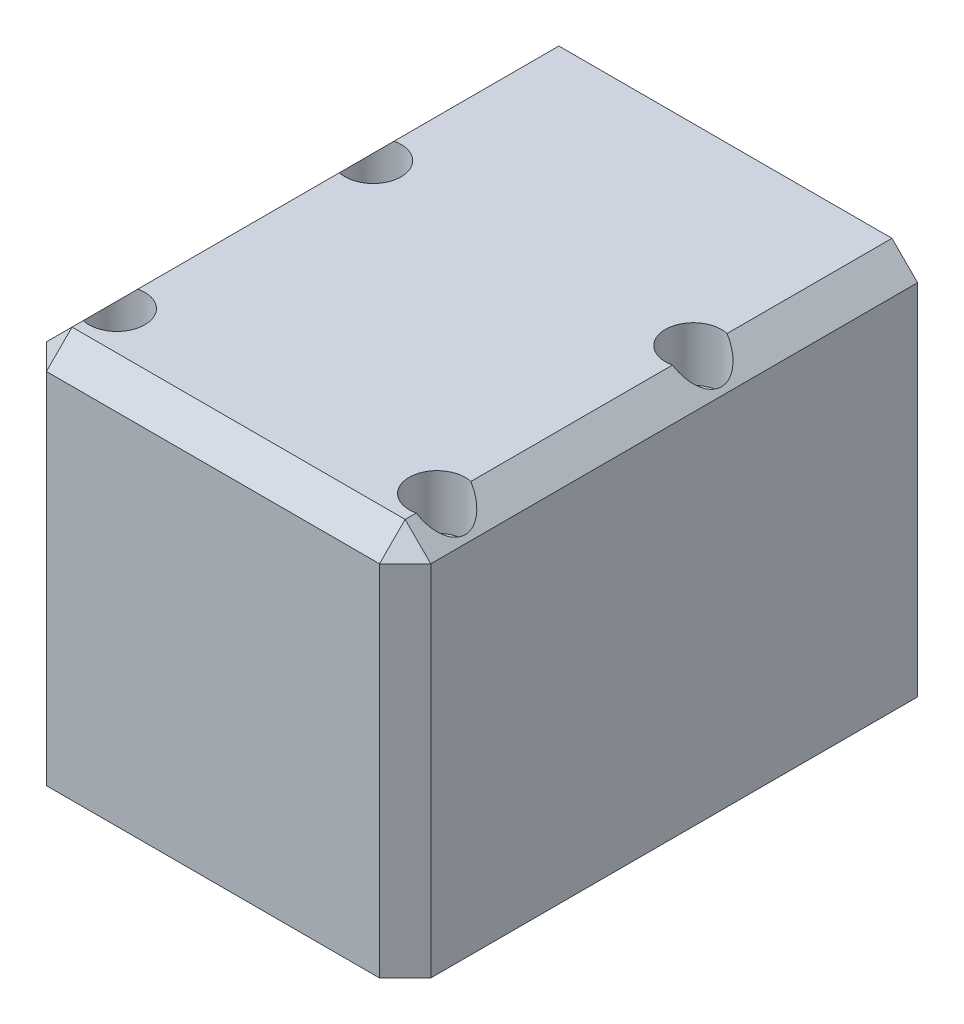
ISO-10303-21;
HEADER;
FILE_DESCRIPTION(('STEP AP214'),'2;1');
FILE_NAME('part.step','',(''),(''),'','','');
FILE_SCHEMA(('AUTOMOTIVE_DESIGN { 1 0 10303 214 1 1 1 1 }'));
ENDSEC;
DATA;
#1=APPLICATION_CONTEXT('core data for automotive mechanical design processes');
#2=APPLICATION_PROTOCOL_DEFINITION('international standard','automotive_design',2000,#1);
#3=PRODUCT_CONTEXT('',#1,'mechanical');
#4=PRODUCT('Part','Part','',(#3));
#5=PRODUCT_RELATED_PRODUCT_CATEGORY('part','',(#4));
#6=PRODUCT_DEFINITION_FORMATION('','',#4);
#7=PRODUCT_DEFINITION_CONTEXT('part definition',#1,'design');
#8=PRODUCT_DEFINITION('design','',#6,#7);
#9=PRODUCT_DEFINITION_SHAPE('','',#8);
#10=(LENGTH_UNIT() NAMED_UNIT(*) SI_UNIT(.MILLI.,.METRE.));
#11=(NAMED_UNIT(*) PLANE_ANGLE_UNIT() SI_UNIT($,.RADIAN.));
#12=(NAMED_UNIT(*) SI_UNIT($,.STERADIAN.) SOLID_ANGLE_UNIT());
#13=UNCERTAINTY_MEASURE_WITH_UNIT(LENGTH_MEASURE(1.E-05),#10,'distance_accuracy_value','');
#14=(GEOMETRIC_REPRESENTATION_CONTEXT(3) GLOBAL_UNCERTAINTY_ASSIGNED_CONTEXT((#13)) GLOBAL_UNIT_ASSIGNED_CONTEXT((#10,
#11,#12)) REPRESENTATION_CONTEXT('',''));
#15=CARTESIAN_POINT('',(0.,0.,0.));
#16=DIRECTION('',(0.,0.,1.));
#17=DIRECTION('',(1.,0.,0.));
#18=AXIS2_PLACEMENT_3D('',#15,#16,#17);
#19=CARTESIAN_POINT('',(0.,0.,50.8));
#20=DIRECTION('',(1.,0.,0.));
#21=DIRECTION('',(0.,1.,0.));
#22=AXIS2_PLACEMENT_3D('',#19,#20,#21);
#23=PLANE('',#22);
#24=DIRECTION('',(0.,0.,-1.));
#25=VECTOR('',#24,1.);
#26=CARTESIAN_POINT('',(0.,0.,50.8));
#27=LINE('',#26,#25);
#28=CARTESIAN_POINT('',(0.,0.,48.26));
#29=VERTEX_POINT('',#28);
#30=CARTESIAN_POINT('',(0.,0.,0.));
#31=VERTEX_POINT('',#30);
#32=EDGE_CURVE('E255',#29,#31,#27,.T.);
#33=ORIENTED_EDGE('',*,*,#32,.F.);
#34=DIRECTION('',(0.,1.,0.));
#35=VECTOR('',#34,1.);
#36=CARTESIAN_POINT('',(0.,0.,48.26));
#37=LINE('',#36,#35);
#38=CARTESIAN_POINT('',(0.,35.56,48.26));
#39=VERTEX_POINT('',#38);
#40=EDGE_CURVE('E257',#29,#39,#37,.T.);
#41=ORIENTED_EDGE('',*,*,#40,.T.);
#42=DIRECTION('',(0.,0.,-1.));
#43=VECTOR('',#42,1.);
#44=CARTESIAN_POINT('',(0.,35.56,50.8));
#45=LINE('',#44,#43);
#46=CARTESIAN_POINT('',(0.,35.56,0.));
#47=VERTEX_POINT('',#46);
#48=EDGE_CURVE('E275',#39,#47,#45,.T.);
#49=ORIENTED_EDGE('',*,*,#48,.T.);
#50=DIRECTION('',(0.,-1.,0.));
#51=VECTOR('',#50,1.);
#52=CARTESIAN_POINT('',(0.,0.,0.));
#53=LINE('',#52,#51);
#54=EDGE_CURVE('E260',#47,#31,#53,.T.);
#55=ORIENTED_EDGE('',*,*,#54,.T.);
#56=EDGE_LOOP('',(#33,#41,#49,#55));
#57=FACE_BOUND('',#56,.T.);
#58=ADVANCED_FACE('F36',(#57),#23,.F.);
#59=CARTESIAN_POINT('',(0.,0.,50.8));
#60=DIRECTION('',(0.,1.,0.));
#61=DIRECTION('',(0.,0.,1.));
#62=AXIS2_PLACEMENT_3D('',#59,#60,#61);
#63=PLANE('',#62);
#64=CARTESIAN_POINT('',(34.925,0.,44.45));
#65=DIRECTION('',(0.,1.,0.));
#66=DIRECTION('',(0.,0.,1.));
#67=AXIS2_PLACEMENT_3D('',#64,#65,#66);
#68=CIRCLE('',#67,1.63194999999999);
#69=CARTESIAN_POINT('',(34.925,0.,46.08195));
#70=VERTEX_POINT('',#69);
#71=EDGE_CURVE('E309',#70,#70,#68,.T.);
#72=ORIENTED_EDGE('',*,*,#71,.T.);
#73=EDGE_LOOP('',(#72));
#74=FACE_BOUND('',#73,.T.);
#75=CARTESIAN_POINT('',(34.925,0.,19.05));
#76=DIRECTION('',(0.,1.,0.));
#77=DIRECTION('',(0.,0.,1.));
#78=AXIS2_PLACEMENT_3D('',#75,#76,#77);
#79=CIRCLE('',#78,1.63194999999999);
#80=CARTESIAN_POINT('',(34.925,0.,20.68195));
#81=VERTEX_POINT('',#80);
#82=EDGE_CURVE('E682',#81,#81,#79,.T.);
#83=ORIENTED_EDGE('',*,*,#82,.T.);
#84=EDGE_LOOP('',(#83));
#85=FACE_BOUND('',#84,.T.);
#86=CARTESIAN_POINT('',(3.17499999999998,0.,19.05));
#87=DIRECTION('',(0.,1.,0.));
#88=DIRECTION('',(0.,0.,1.));
#89=AXIS2_PLACEMENT_3D('',#86,#87,#88);
#90=CIRCLE('',#89,1.63194999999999);
#91=CARTESIAN_POINT('',(3.17499999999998,0.,20.68195));
#92=VERTEX_POINT('',#91);
#93=EDGE_CURVE('E298',#92,#92,#90,.T.);
#94=ORIENTED_EDGE('',*,*,#93,.T.);
#95=EDGE_LOOP('',(#94));
#96=FACE_BOUND('',#95,.T.);
#97=CARTESIAN_POINT('',(3.17499999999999,0.,44.45));
#98=DIRECTION('',(0.,1.,0.));
#99=DIRECTION('',(0.,0.,1.));
#100=AXIS2_PLACEMENT_3D('',#97,#98,#99);
#101=CIRCLE('',#100,1.63194999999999);
#102=CARTESIAN_POINT('',(3.17499999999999,0.,46.08195));
#103=VERTEX_POINT('',#102);
#104=EDGE_CURVE('E699',#103,#103,#101,.T.);
#105=ORIENTED_EDGE('',*,*,#104,.T.);
#106=EDGE_LOOP('',(#105));
#107=FACE_BOUND('',#106,.T.);
#108=CARTESIAN_POINT('',(19.05,0.,34.798));
#109=DIRECTION('',(0.,-1.,0.));
#110=DIRECTION('',(0.,0.,-1.));
#111=AXIS2_PLACEMENT_3D('',#108,#109,#110);
#112=CIRCLE('',#111,9.525);
#113=CARTESIAN_POINT('',(19.05,0.,25.273));
#114=VERTEX_POINT('',#113);
#115=EDGE_CURVE('E165',#114,#114,#112,.T.);
#116=ORIENTED_EDGE('',*,*,#115,.F.);
#117=EDGE_LOOP('',(#116));
#118=FACE_BOUND('',#117,.T.);
#119=DIRECTION('',(0.,0.,-1.));
#120=VECTOR('',#119,1.);
#121=CARTESIAN_POINT('',(38.1,0.,50.8));
#122=LINE('',#121,#120);
#123=CARTESIAN_POINT('',(38.1,0.,48.26));
#124=VERTEX_POINT('',#123);
#125=CARTESIAN_POINT('',(38.1,0.,0.));
#126=VERTEX_POINT('',#125);
#127=EDGE_CURVE('E265',#124,#126,#122,.T.);
#128=ORIENTED_EDGE('',*,*,#127,.F.);
#129=DIRECTION('',(0.707106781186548,0.,-0.707106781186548));
#130=VECTOR('',#129,1.);
#131=CARTESIAN_POINT('',(35.56,0.,50.8));
#132=LINE('',#131,#130);
#133=CARTESIAN_POINT('',(35.56,0.,50.8));
#134=VERTEX_POINT('',#133);
#135=EDGE_CURVE('E279',#124,#134,#132,.F.);
#136=ORIENTED_EDGE('',*,*,#135,.T.);
#137=DIRECTION('',(1.,0.,0.));
#138=VECTOR('',#137,1.);
#139=CARTESIAN_POINT('',(0.,0.,50.8));
#140=LINE('',#139,#138);
#141=CARTESIAN_POINT('',(2.54,0.,50.8));
#142=VERTEX_POINT('',#141);
#143=EDGE_CURVE('E324',#142,#134,#140,.T.);
#144=ORIENTED_EDGE('',*,*,#143,.F.);
#145=DIRECTION('',(0.707106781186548,0.,0.707106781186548));
#146=VECTOR('',#145,1.);
#147=CARTESIAN_POINT('',(2.54,0.,50.8));
#148=LINE('',#147,#146);
#149=EDGE_CURVE('E270',#142,#29,#148,.F.);
#150=ORIENTED_EDGE('',*,*,#149,.T.);
#151=ORIENTED_EDGE('',*,*,#32,.T.);
#152=DIRECTION('',(1.,0.,0.));
#153=VECTOR('',#152,1.);
#154=CARTESIAN_POINT('',(0.,0.,0.));
#155=LINE('',#154,#153);
#156=EDGE_CURVE('E322',#31,#126,#155,.T.);
#157=ORIENTED_EDGE('',*,*,#156,.T.);
#158=EDGE_LOOP('',(#128,#136,#144,#150,#151,#157));
#159=FACE_BOUND('',#158,.T.);
#160=ADVANCED_FACE('F246',(#74,#85,#96,#107,#118,#159),#63,.F.);
#161=CARTESIAN_POINT('',(38.1,0.,50.8));
#162=DIRECTION('',(-1.,0.,0.));
#163=DIRECTION('',(0.,-1.,0.));
#164=AXIS2_PLACEMENT_3D('',#161,#162,#163);
#165=PLANE('',#164);
#166=DIRECTION('',(0.,0.,1.));
#167=VECTOR('',#166,1.);
#168=CARTESIAN_POINT('',(38.1,35.56,50.8));
#169=LINE('',#168,#167);
#170=CARTESIAN_POINT('',(38.1,35.56,0.));
#171=VERTEX_POINT('',#170);
#172=CARTESIAN_POINT('',(38.1,35.56,48.26));
#173=VERTEX_POINT('',#172);
#174=EDGE_CURVE('E314',#171,#173,#169,.T.);
#175=ORIENTED_EDGE('',*,*,#174,.T.);
#176=DIRECTION('',(0.,-1.,0.));
#177=VECTOR('',#176,1.);
#178=CARTESIAN_POINT('',(38.1,0.,48.26));
#179=LINE('',#178,#177);
#180=EDGE_CURVE('E339',#173,#124,#179,.T.);
#181=ORIENTED_EDGE('',*,*,#180,.T.);
#182=ORIENTED_EDGE('',*,*,#127,.T.);
#183=DIRECTION('',(0.,1.,0.));
#184=VECTOR('',#183,1.);
#185=CARTESIAN_POINT('',(38.1,0.,0.));
#186=LINE('',#185,#184);
#187=EDGE_CURVE('E318',#126,#171,#186,.T.);
#188=ORIENTED_EDGE('',*,*,#187,.T.);
#189=EDGE_LOOP('',(#175,#181,#182,#188));
#190=FACE_BOUND('',#189,.T.);
#191=ADVANCED_FACE('F251',(#190),#165,.F.);
#192=CARTESIAN_POINT('',(0.,38.1,50.8));
#193=DIRECTION('',(0.,-1.,0.));
#194=DIRECTION('',(0.,0.,-1.));
#195=AXIS2_PLACEMENT_3D('',#192,#193,#194);
#196=PLANE('',#195);
#197=DIRECTION('',(0.,0.,-1.));
#198=VECTOR('',#197,1.);
#199=CARTESIAN_POINT('',(35.56,38.1,50.8));
#200=LINE('',#199,#198);
#201=CARTESIAN_POINT('',(35.56,38.1,48.26));
#202=VERTEX_POINT('',#201);
#203=CARTESIAN_POINT('',(35.56,38.1,47.1552323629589));
#204=VERTEX_POINT('',#203);
#205=EDGE_CURVE('E139',#202,#204,#200,.T.);
#206=ORIENTED_EDGE('',*,*,#205,.T.);
#207=CARTESIAN_POINT('',(34.925,38.1,44.45));
#208=DIRECTION('',(0.,1.,0.));
#209=DIRECTION('',(0.,0.,1.));
#210=AXIS2_PLACEMENT_3D('',#207,#208,#209);
#211=CIRCLE('',#210,2.77875999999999);
#212=CARTESIAN_POINT('',(35.56,38.1,41.7447676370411));
#213=VERTEX_POINT('',#212);
#214=EDGE_CURVE('E48',#213,#204,#211,.T.);
#215=ORIENTED_EDGE('',*,*,#214,.F.);
#216=CARTESIAN_POINT('',(35.56,38.1,21.7552323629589));
#217=VERTEX_POINT('',#216);
#218=EDGE_CURVE('E55',#213,#217,#200,.T.);
#219=ORIENTED_EDGE('',*,*,#218,.T.);
#220=CARTESIAN_POINT('',(34.925,38.1,19.05));
#221=DIRECTION('',(0.,1.,0.));
#222=DIRECTION('',(0.,0.,1.));
#223=AXIS2_PLACEMENT_3D('',#220,#221,#222);
#224=CIRCLE('',#223,2.77875999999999);
#225=CARTESIAN_POINT('',(35.56,38.1,16.3447676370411));
#226=VERTEX_POINT('',#225);
#227=EDGE_CURVE('E306',#226,#217,#224,.T.);
#228=ORIENTED_EDGE('',*,*,#227,.F.);
#229=CARTESIAN_POINT('',(35.56,38.1,0.));
#230=VERTEX_POINT('',#229);
#231=EDGE_CURVE('E145',#226,#230,#200,.T.);
#232=ORIENTED_EDGE('',*,*,#231,.T.);
#233=DIRECTION('',(-1.,0.,0.));
#234=VECTOR('',#233,1.);
#235=CARTESIAN_POINT('',(0.,38.1,0.));
#236=LINE('',#235,#234);
#237=CARTESIAN_POINT('',(2.54,38.1,0.));
#238=VERTEX_POINT('',#237);
#239=EDGE_CURVE('E319',#230,#238,#236,.T.);
#240=ORIENTED_EDGE('',*,*,#239,.T.);
#241=DIRECTION('',(0.,0.,1.));
#242=VECTOR('',#241,1.);
#243=CARTESIAN_POINT('',(2.54,38.1,50.8));
#244=LINE('',#243,#242);
#245=CARTESIAN_POINT('',(2.54,38.1,16.3447676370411));
#246=VERTEX_POINT('',#245);
#247=EDGE_CURVE('E278',#238,#246,#244,.T.);
#248=ORIENTED_EDGE('',*,*,#247,.T.);
#249=CARTESIAN_POINT('',(3.17499999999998,38.1,19.05));
#250=DIRECTION('',(0.,1.,0.));
#251=DIRECTION('',(0.,0.,1.));
#252=AXIS2_PLACEMENT_3D('',#249,#250,#251);
#253=CIRCLE('',#252,2.77875999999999);
#254=CARTESIAN_POINT('',(2.54,38.1,21.7552323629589));
#255=VERTEX_POINT('',#254);
#256=EDGE_CURVE('E291',#255,#246,#253,.T.);
#257=ORIENTED_EDGE('',*,*,#256,.F.);
#258=CARTESIAN_POINT('',(2.54,38.1,41.7447676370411));
#259=VERTEX_POINT('',#258);
#260=EDGE_CURVE('E277',#255,#259,#244,.T.);
#261=ORIENTED_EDGE('',*,*,#260,.T.);
#262=CARTESIAN_POINT('',(3.17499999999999,38.1,44.45));
#263=DIRECTION('',(0.,1.,0.));
#264=DIRECTION('',(0.,0.,1.));
#265=AXIS2_PLACEMENT_3D('',#262,#263,#264);
#266=CIRCLE('',#265,2.77875999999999);
#267=CARTESIAN_POINT('',(2.54,38.1,47.1552323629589));
#268=VERTEX_POINT('',#267);
#269=EDGE_CURVE('E289',#268,#259,#266,.T.);
#270=ORIENTED_EDGE('',*,*,#269,.F.);
#271=CARTESIAN_POINT('',(2.54,38.1,48.26));
#272=VERTEX_POINT('',#271);
#273=EDGE_CURVE('E274',#268,#272,#244,.T.);
#274=ORIENTED_EDGE('',*,*,#273,.T.);
#275=DIRECTION('',(1.,0.,0.));
#276=VECTOR('',#275,1.);
#277=CARTESIAN_POINT('',(0.,38.1,48.26));
#278=LINE('',#277,#276);
#279=EDGE_CURVE('E148',#272,#202,#278,.T.);
#280=ORIENTED_EDGE('',*,*,#279,.T.);
#281=EDGE_LOOP('',(#206,#215,#219,#228,#232,#240,#248,#257,#261,#270,#274,#280));
#282=FACE_BOUND('',#281,.T.);
#283=ADVANCED_FACE('F138',(#282),#196,.F.);
#284=CARTESIAN_POINT('',(0.,38.1,50.8));
#285=DIRECTION('',(0.,0.,-1.));
#286=DIRECTION('',(-1.,0.,0.));
#287=AXIS2_PLACEMENT_3D('',#284,#285,#286);
#288=PLANE('',#287);
#289=ORIENTED_EDGE('',*,*,#143,.T.);
#290=DIRECTION('',(0.,1.,0.));
#291=VECTOR('',#290,1.);
#292=CARTESIAN_POINT('',(35.56,38.1,50.8));
#293=LINE('',#292,#291);
#294=CARTESIAN_POINT('',(35.56,35.56,50.8));
#295=VERTEX_POINT('',#294);
#296=EDGE_CURVE('E335',#134,#295,#293,.T.);
#297=ORIENTED_EDGE('',*,*,#296,.T.);
#298=DIRECTION('',(-1.,0.,0.));
#299=VECTOR('',#298,1.);
#300=CARTESIAN_POINT('',(0.,35.56,50.8));
#301=LINE('',#300,#299);
#302=CARTESIAN_POINT('',(2.54,35.56,50.8));
#303=VERTEX_POINT('',#302);
#304=EDGE_CURVE('E264',#295,#303,#301,.T.);
#305=ORIENTED_EDGE('',*,*,#304,.T.);
#306=DIRECTION('',(0.,-1.,0.));
#307=VECTOR('',#306,1.);
#308=CARTESIAN_POINT('',(2.54,38.1,50.8));
#309=LINE('',#308,#307);
#310=EDGE_CURVE('E333',#303,#142,#309,.T.);
#311=ORIENTED_EDGE('',*,*,#310,.T.);
#312=EDGE_LOOP('',(#289,#297,#305,#311));
#313=FACE_BOUND('',#312,.T.);
#314=ADVANCED_FACE('F346',(#313),#288,.F.);
#315=CARTESIAN_POINT('',(0.,38.1,0.));
#316=DIRECTION('',(0.,0.,-1.));
#317=DIRECTION('',(-1.,0.,0.));
#318=AXIS2_PLACEMENT_3D('',#315,#316,#317);
#319=PLANE('',#318);
#320=CARTESIAN_POINT('',(6.745,31.355,0.));
#321=DIRECTION('',(0.,0.,-1.));
#322=DIRECTION('',(-1.,0.,0.));
#323=AXIS2_PLACEMENT_3D('',#320,#321,#322);
#324=CIRCLE('',#323,1.1303);
#325=CARTESIAN_POINT('',(5.61470000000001,31.355,0.));
#326=VERTEX_POINT('',#325);
#327=EDGE_CURVE('E364',#326,#326,#324,.T.);
#328=ORIENTED_EDGE('',*,*,#327,.F.);
#329=EDGE_LOOP('',(#328));
#330=FACE_BOUND('',#329,.T.);
#331=CARTESIAN_POINT('',(6.745,6.74500000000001,0.));
#332=DIRECTION('',(0.,0.,-1.));
#333=DIRECTION('',(-1.,0.,0.));
#334=AXIS2_PLACEMENT_3D('',#331,#332,#333);
#335=CIRCLE('',#334,1.1303);
#336=CARTESIAN_POINT('',(5.61470000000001,6.74500000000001,0.));
#337=VERTEX_POINT('',#336);
#338=EDGE_CURVE('E374',#337,#337,#335,.T.);
#339=ORIENTED_EDGE('',*,*,#338,.F.);
#340=EDGE_LOOP('',(#339));
#341=FACE_BOUND('',#340,.T.);
#342=CARTESIAN_POINT('',(31.355,6.745,0.));
#343=DIRECTION('',(0.,0.,-1.));
#344=DIRECTION('',(-1.,0.,0.));
#345=AXIS2_PLACEMENT_3D('',#342,#343,#344);
#346=CIRCLE('',#345,1.1303);
#347=CARTESIAN_POINT('',(30.2247,6.745,0.));
#348=VERTEX_POINT('',#347);
#349=EDGE_CURVE('E380',#348,#348,#346,.T.);
#350=ORIENTED_EDGE('',*,*,#349,.F.);
#351=EDGE_LOOP('',(#350));
#352=FACE_BOUND('',#351,.T.);
#353=CARTESIAN_POINT('',(31.355,31.355,0.));
#354=DIRECTION('',(0.,0.,-1.));
#355=DIRECTION('',(-1.,0.,0.));
#356=AXIS2_PLACEMENT_3D('',#353,#354,#355);
#357=CIRCLE('',#356,1.1303);
#358=CARTESIAN_POINT('',(30.2247,31.355,0.));
#359=VERTEX_POINT('',#358);
#360=EDGE_CURVE('E386',#359,#359,#357,.T.);
#361=ORIENTED_EDGE('',*,*,#360,.F.);
#362=EDGE_LOOP('',(#361));
#363=FACE_BOUND('',#362,.T.);
#364=CARTESIAN_POINT('',(19.05,19.05,0.));
#365=DIRECTION('',(0.,0.,-1.));
#366=DIRECTION('',(-1.,0.,0.));
#367=AXIS2_PLACEMENT_3D('',#364,#365,#366);
#368=CIRCLE('',#367,13.97);
#369=CARTESIAN_POINT('',(5.08,19.05,0.));
#370=VERTEX_POINT('',#369);
#371=EDGE_CURVE('E389',#370,#370,#368,.T.);
#372=ORIENTED_EDGE('',*,*,#371,.F.);
#373=EDGE_LOOP('',(#372));
#374=FACE_BOUND('',#373,.T.);
#375=ORIENTED_EDGE('',*,*,#239,.F.);
#376=DIRECTION('',(-0.707106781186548,0.707106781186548,0.));
#377=VECTOR('',#376,1.);
#378=CARTESIAN_POINT('',(17.78,55.88,0.));
#379=LINE('',#378,#377);
#380=EDGE_CURVE('E153',#230,#171,#379,.F.);
#381=ORIENTED_EDGE('',*,*,#380,.T.);
#382=ORIENTED_EDGE('',*,*,#187,.F.);
#383=ORIENTED_EDGE('',*,*,#156,.F.);
#384=ORIENTED_EDGE('',*,*,#54,.F.);
#385=DIRECTION('',(-0.707106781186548,-0.707106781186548,0.));
#386=VECTOR('',#385,1.);
#387=CARTESIAN_POINT('',(1.27,36.83,0.));
#388=LINE('',#387,#386);
#389=EDGE_CURVE('E147',#47,#238,#388,.F.);
#390=ORIENTED_EDGE('',*,*,#389,.T.);
#391=EDGE_LOOP('',(#375,#381,#382,#383,#384,#390));
#392=FACE_BOUND('',#391,.T.);
#393=ADVANCED_FACE('F242',(#330,#341,#352,#363,#374,#392),#319,.T.);
#394=CARTESIAN_POINT('',(19.05,19.05,44.45));
#395=DIRECTION('',(0.,0.,-1.));
#396=DIRECTION('',(-1.,0.,0.));
#397=AXIS2_PLACEMENT_3D('',#394,#395,#396);
#398=CYLINDRICAL_SURFACE('',#397,13.97);
#399=CARTESIAN_POINT('',(19.05,5.08,25.273));
#400=CARTESIAN_POINT('',(19.2881217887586,5.08000073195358,25.2730007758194));
#401=CARTESIAN_POINT('',(19.5262553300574,5.08610162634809,25.281942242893));
#402=CARTESIAN_POINT('',(20.0005755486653,5.11035462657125,25.3175671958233));
#403=CARTESIAN_POINT('',(20.2367621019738,5.12850749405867,25.3442518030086));
#404=CARTESIAN_POINT('',(20.7054484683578,5.17643108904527,25.4149666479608));
#405=CARTESIAN_POINT('',(20.9379462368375,5.20620804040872,25.459006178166));
#406=CARTESIAN_POINT('',(21.3974405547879,5.27667591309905,25.5637873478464));
#407=CARTESIAN_POINT('',(21.6244371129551,5.31736681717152,25.6245289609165));
#408=CARTESIAN_POINT('',(22.0703260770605,5.40851719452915,25.7615526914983));
#409=CARTESIAN_POINT('',(22.2892542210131,5.45892524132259,25.8377531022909));
#410=CARTESIAN_POINT('',(22.7191350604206,5.56862090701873,26.0050314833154));
#411=CARTESIAN_POINT('',(22.9300846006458,5.62791199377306,26.0961152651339));
#412=CARTESIAN_POINT('',(23.3428970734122,5.75419193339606,26.2921867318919));
#413=CARTESIAN_POINT('',(23.5447635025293,5.82117778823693,26.3971690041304));
#414=CARTESIAN_POINT('',(23.9388403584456,5.96168751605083,26.6202158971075));
#415=CARTESIAN_POINT('',(24.1310471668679,6.03521381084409,26.7382853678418));
#416=CARTESIAN_POINT('',(24.5213207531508,6.19411874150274,26.9973739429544));
#417=CARTESIAN_POINT('',(24.7184627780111,6.27997266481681,27.1394941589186));
#418=CARTESIAN_POINT('',(25.1000837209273,6.45628810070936,27.437245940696));
#419=CARTESIAN_POINT('',(25.2845612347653,6.54675012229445,27.5928790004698));
#420=CARTESIAN_POINT('',(25.640680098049,6.73074426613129,27.9171107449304));
#421=CARTESIAN_POINT('',(25.8123015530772,6.82428083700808,28.0857287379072));
#422=CARTESIAN_POINT('',(26.1419553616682,7.01251316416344,28.4350249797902));
#423=CARTESIAN_POINT('',(26.2999919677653,7.10720854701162,28.615699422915));
#424=CARTESIAN_POINT('',(26.6272988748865,7.3116614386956,29.0197176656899));
#425=CARTESIAN_POINT('',(26.7940627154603,7.42130331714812,29.2451590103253));
#426=CARTESIAN_POINT('',(27.1079080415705,7.63653271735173,29.7112817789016));
#427=CARTESIAN_POINT('',(27.2549847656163,7.74211925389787,29.9519668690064));
#428=CARTESIAN_POINT('',(27.528166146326,7.94547177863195,30.4475677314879));
#429=CARTESIAN_POINT('',(27.6543041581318,8.04325007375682,30.702459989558));
#430=CARTESIAN_POINT('',(27.8845520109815,8.22718521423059,31.226154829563));
#431=CARTESIAN_POINT('',(27.9886615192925,8.31334188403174,31.4949576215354));
#432=CARTESIAN_POINT('',(28.1454997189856,8.4462286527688,31.9627155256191));
#433=CARTESIAN_POINT('',(28.2042806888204,8.49704136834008,32.1584980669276));
#434=CARTESIAN_POINT('',(28.3095123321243,8.58925294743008,32.5554197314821));
#435=CARTESIAN_POINT('',(28.3559709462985,8.63065787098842,32.7565553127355));
#436=CARTESIAN_POINT('',(28.4359129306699,8.70261207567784,33.163036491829));
#437=CARTESIAN_POINT('',(28.4694133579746,8.73317562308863,33.3683761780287));
#438=CARTESIAN_POINT('',(28.5229817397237,8.78233974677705,33.7822388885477));
#439=CARTESIAN_POINT('',(28.5430496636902,8.80094029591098,33.9907619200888));
#440=CARTESIAN_POINT('',(28.5694460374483,8.8254521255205,34.410454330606));
#441=CARTESIAN_POINT('',(28.5757070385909,8.83130111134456,34.621631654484));
#442=CARTESIAN_POINT('',(28.574166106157,8.82986493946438,35.0438893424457));
#443=CARTESIAN_POINT('',(28.5663641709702,8.82257978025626,35.2549697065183));
#444=CARTESIAN_POINT('',(28.5368424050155,8.79519036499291,35.6754364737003));
#445=CARTESIAN_POINT('',(28.5151139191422,8.77507813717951,35.8848217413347));
#446=CARTESIAN_POINT('',(28.4581316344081,8.72287821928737,36.3002132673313));
#447=CARTESIAN_POINT('',(28.4228775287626,8.69079025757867,36.5062194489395));
#448=CARTESIAN_POINT('',(28.3416690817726,8.61790601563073,36.9025650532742));
#449=CARTESIAN_POINT('',(28.2963960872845,8.57767416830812,37.0931494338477));
#450=CARTESIAN_POINT('',(28.1947991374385,8.4888397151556,37.4693823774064));
#451=CARTESIAN_POINT('',(28.1384710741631,8.44023399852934,37.6550290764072));
#452=CARTESIAN_POINT('',(27.9536777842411,8.28378323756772,38.2037362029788));
#453=CARTESIAN_POINT('',(27.8093965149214,8.16529807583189,38.5585968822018));
#454=CARTESIAN_POINT('',(27.5241878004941,7.94266013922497,39.1562192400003));
#455=CARTESIAN_POINT('',(27.3916554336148,7.84247082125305,39.4046196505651));
#456=CARTESIAN_POINT('',(27.1064559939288,7.63573566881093,39.886969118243));
#457=CARTESIAN_POINT('',(26.953781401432,7.52918746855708,40.120912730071));
#458=CARTESIAN_POINT('',(26.6290045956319,7.31297647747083,40.5739988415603));
#459=CARTESIAN_POINT('',(26.4568703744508,7.20330878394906,40.7931159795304));
#460=CARTESIAN_POINT('',(26.0940945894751,6.9840750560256,41.2154627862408));
#461=CARTESIAN_POINT('',(25.9034552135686,6.8745090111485,41.4186943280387));
#462=CARTESIAN_POINT('',(25.5024498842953,6.65729012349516,41.8101848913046));
#463=CARTESIAN_POINT('',(25.2919213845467,6.54966348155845,41.998292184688));
#464=CARTESIAN_POINT('',(24.8532388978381,6.34006651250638,42.3563193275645));
#465=CARTESIAN_POINT('',(24.6250833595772,6.23809668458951,42.5262375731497));
#466=CARTESIAN_POINT('',(24.1524126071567,6.04263376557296,42.8461238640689));
#467=CARTESIAN_POINT('',(23.90792737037,5.94912584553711,42.9961270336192));
#468=CARTESIAN_POINT('',(23.4034123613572,5.77295118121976,43.2748158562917));
#469=CARTESIAN_POINT('',(23.1433872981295,5.69028117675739,43.4035079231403));
#470=CARTESIAN_POINT('',(22.6686471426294,5.55507504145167,43.6117685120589));
#471=CARTESIAN_POINT('',(22.4566685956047,5.49992165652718,43.6959022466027));
#472=CARTESIAN_POINT('',(22.0252953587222,5.3987155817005,43.8492770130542));
#473=CARTESIAN_POINT('',(21.8059021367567,5.35266110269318,43.9185209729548));
#474=CARTESIAN_POINT('',(21.3610185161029,5.27062302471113,44.0412698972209));
#475=CARTESIAN_POINT('',(21.135531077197,5.23463463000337,44.0947823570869));
#476=CARTESIAN_POINT('',(20.6798183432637,5.17349330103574,44.1854002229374));
#477=CARTESIAN_POINT('',(20.4495929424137,5.14834060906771,44.2225052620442));
#478=CARTESIAN_POINT('',(19.9852735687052,5.10938938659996,44.2798666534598));
#479=CARTESIAN_POINT('',(19.7511689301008,5.09563062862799,44.3000639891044));
#480=CARTESIAN_POINT('',(19.2817080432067,5.07994743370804,44.3230808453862));
#481=CARTESIAN_POINT('',(19.0463517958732,5.07802298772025,44.3259003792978));
#482=CARTESIAN_POINT('',(18.5762723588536,5.08605547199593,44.3141173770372));
#483=CARTESIAN_POINT('',(18.3415491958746,5.09601289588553,44.2995141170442));
#484=CARTESIAN_POINT('',(17.874609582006,5.12756799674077,44.2531111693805));
#485=CARTESIAN_POINT('',(17.642393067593,5.14916537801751,44.2213119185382));
#486=CARTESIAN_POINT('',(17.1947620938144,5.20200399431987,44.1431857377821));
#487=CARTESIAN_POINT('',(16.97912180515,5.23265529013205,44.0977453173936));
#488=CARTESIAN_POINT('',(16.5528752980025,5.30329294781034,43.9924659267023));
#489=CARTESIAN_POINT('',(16.3422708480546,5.34328253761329,43.93262197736));
#490=CARTESIAN_POINT('',(15.9273715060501,5.43181069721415,43.7992383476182));
#491=CARTESIAN_POINT('',(15.7230748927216,5.48034691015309,43.72570244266));
#492=CARTESIAN_POINT('',(15.3216032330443,5.5851190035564,43.5656340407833));
#493=CARTESIAN_POINT('',(15.1244308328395,5.64135770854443,43.4790967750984));
#494=CARTESIAN_POINT('',(14.7227019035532,5.76530905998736,43.286439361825));
#495=CARTESIAN_POINT('',(14.518801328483,5.83357810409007,43.1793100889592));
#496=CARTESIAN_POINT('',(14.1209402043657,5.976745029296,42.9516834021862));
#497=CARTESIAN_POINT('',(13.9269838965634,6.05164570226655,42.831180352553));
#498=CARTESIAN_POINT('',(13.5495880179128,6.2067913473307,42.5776396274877));
#499=CARTESIAN_POINT('',(13.3661525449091,6.28703837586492,42.4445971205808));
#500=CARTESIAN_POINT('',(13.0102989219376,6.4515340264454,42.1667586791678));
#501=CARTESIAN_POINT('',(12.8378819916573,6.53578308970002,42.0219614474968));
#502=CARTESIAN_POINT('',(12.4764157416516,6.72130234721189,41.6959980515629));
#503=CARTESIAN_POINT('',(12.2894353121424,6.82305511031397,41.5128077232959));
#504=CARTESIAN_POINT('',(11.9314780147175,7.02793350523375,41.1320793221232));
#505=CARTESIAN_POINT('',(11.7605036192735,7.13105934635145,40.9345390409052));
#506=CARTESIAN_POINT('',(11.4350225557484,7.33633055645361,40.5256575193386));
#507=CARTESIAN_POINT('',(11.2805241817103,7.43847540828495,40.3143094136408));
#508=CARTESIAN_POINT('',(10.9887505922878,7.63910641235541,39.8784183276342));
#509=CARTESIAN_POINT('',(10.8514726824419,7.73759313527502,39.6538774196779));
#510=CARTESIAN_POINT('',(10.6124091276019,7.91505424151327,39.2234674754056));
#511=CARTESIAN_POINT('',(10.5083355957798,7.99486081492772,39.0192114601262));
#512=CARTESIAN_POINT('',(10.3143418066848,8.14750443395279,38.601539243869));
#513=CARTESIAN_POINT('',(10.2244213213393,8.22034159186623,38.3881231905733));
#514=CARTESIAN_POINT('',(10.0597082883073,8.35668551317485,37.9530426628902));
#515=CARTESIAN_POINT('',(9.98489134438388,8.4202072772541,37.7313921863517));
#516=CARTESIAN_POINT('',(9.8511654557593,8.53571603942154,37.2804068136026));
#517=CARTESIAN_POINT('',(9.79225316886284,8.58770546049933,37.0510735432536));
#518=CARTESIAN_POINT('',(9.69977233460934,8.67034130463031,36.6250455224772));
#519=CARTESIAN_POINT('',(9.66361097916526,8.70310446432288,36.4293227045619));
#520=CARTESIAN_POINT('',(9.60349672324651,8.75795739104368,36.0345454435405));
#521=CARTESIAN_POINT('',(9.57954148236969,8.78004920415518,35.8354916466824));
#522=CARTESIAN_POINT('',(9.5442364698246,8.81271800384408,35.435470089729));
#523=CARTESIAN_POINT('',(9.53287735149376,8.82330352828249,35.2345038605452));
#524=CARTESIAN_POINT('',(9.52293321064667,8.83256653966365,34.831973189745));
#525=CARTESIAN_POINT('',(9.52434843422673,8.8312437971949,34.6304087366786));
#526=CARTESIAN_POINT('',(9.53992447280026,8.8167466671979,34.2283029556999));
#527=CARTESIAN_POINT('',(9.55407924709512,8.80357789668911,34.0277611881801));
#528=CARTESIAN_POINT('',(9.59487806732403,8.76591842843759,33.6290428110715));
#529=CARTESIAN_POINT('',(9.62152202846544,8.74142780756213,33.4308661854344));
#530=CARTESIAN_POINT('',(9.68690942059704,8.68200208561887,33.0379223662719));
#531=CARTESIAN_POINT('',(9.72566470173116,8.64705675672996,32.8431587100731));
#532=CARTESIAN_POINT('',(9.8147557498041,8.56788621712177,32.4581344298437));
#533=CARTESIAN_POINT('',(9.86509810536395,8.5236557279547,32.2678764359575));
#534=CARTESIAN_POINT('',(9.99449463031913,8.41194757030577,31.8332274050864));
#535=CARTESIAN_POINT('',(10.0775920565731,8.34154452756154,31.5907853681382));
#536=CARTESIAN_POINT('',(10.2616483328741,8.18998269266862,31.116243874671));
#537=CARTESIAN_POINT('',(10.3626138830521,8.10881986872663,30.8841483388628));
#538=CARTESIAN_POINT('',(10.5814470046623,7.93857590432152,30.4307736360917));
#539=CARTESIAN_POINT('',(10.6993336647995,7.84948586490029,30.2095070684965));
#540=CARTESIAN_POINT('',(10.9510531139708,7.66614288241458,29.7785418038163));
#541=CARTESIAN_POINT('',(11.0848848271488,7.5718902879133,29.5688423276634));
#542=CARTESIAN_POINT('',(11.3707169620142,7.3786730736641,29.1572298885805));
#543=CARTESIAN_POINT('',(11.5230314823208,7.27965161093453,28.955561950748));
#544=CARTESIAN_POINT('',(11.843087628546,7.08100648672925,28.5650393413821));
#545=CARTESIAN_POINT('',(12.010835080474,6.98138261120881,28.376189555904));
#546=CARTESIAN_POINT('',(12.361277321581,6.78368977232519,28.0119490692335));
#547=CARTESIAN_POINT('',(12.5439744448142,6.68562105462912,27.8365604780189));
#548=CARTESIAN_POINT('',(12.92382929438,6.49307846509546,27.5000525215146));
#549=CARTESIAN_POINT('',(13.1209866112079,6.39860449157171,27.3389327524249));
#550=CARTESIAN_POINT('',(13.5560844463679,6.20313767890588,27.0117297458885));
#551=CARTESIAN_POINT('',(13.7959810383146,6.1029173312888,26.8477718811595));
#552=CARTESIAN_POINT('',(14.2926829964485,5.91228341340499,26.5409565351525));
#553=CARTESIAN_POINT('',(14.5494910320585,5.82187139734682,26.398102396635));
#554=CARTESIAN_POINT('',(15.0781174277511,5.65366275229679,26.135626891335));
#555=CARTESIAN_POINT('',(15.3499100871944,5.57584537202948,26.0159672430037));
#556=CARTESIAN_POINT('',(15.9068383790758,5.43516224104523,25.8016073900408));
#557=CARTESIAN_POINT('',(16.1919679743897,5.37228980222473,25.7068960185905));
#558=CARTESIAN_POINT('',(16.6889375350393,5.27936086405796,25.5677747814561));
#559=CARTESIAN_POINT('',(16.8981590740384,5.24507114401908,25.5167374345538));
#560=CARTESIAN_POINT('',(17.3208317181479,5.18578778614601,25.4287862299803));
#561=CARTESIAN_POINT('',(17.5342819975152,5.16079235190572,25.391869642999));
#562=CARTESIAN_POINT('',(17.9640186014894,5.12060307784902,25.3326264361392));
#563=CARTESIAN_POINT('',(18.180303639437,5.10540493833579,25.3102934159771));
#564=CARTESIAN_POINT('',(18.6143890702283,5.08510253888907,25.2804790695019));
#565=CARTESIAN_POINT('',(18.8321896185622,5.07999933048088,25.2729992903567));
#566=CARTESIAN_POINT('',(19.05,5.08,25.273));
#567=B_SPLINE_CURVE_WITH_KNOTS('',3,(#399,#400,#401,#402,#403,#404,#405,#406,#407,#408,#409,
#410,#411,#412,#413,#414,#415,#416,#417,#418,#419,#420,#421,#422,#423,#424,#425,#426,#427,#428,
#429,#430,#431,#432,#433,#434,#435,#436,#437,#438,#439,#440,#441,#442,#443,#444,#445,#446,#447,
#448,#449,#450,#451,#452,#453,#454,#455,#456,#457,#458,#459,#460,#461,#462,#463,#464,#465,#466,
#467,#468,#469,#470,#471,#472,#473,#474,#475,#476,#477,#478,#479,#480,#481,#482,#483,#484,#485,
#486,#487,#488,#489,#490,#491,#492,#493,#494,#495,#496,#497,#498,#499,#500,#501,#502,#503,#504,
#505,#506,#507,#508,#509,#510,#511,#512,#513,#514,#515,#516,#517,#518,#519,#520,#521,#522,#523,
#524,#525,#526,#527,#528,#529,#530,#531,#532,#533,#534,#535,#536,#537,#538,#539,#540,#541,#542,
#543,#544,#545,#546,#547,#548,#549,#550,#551,#552,#553,#554,#555,#556,#557,#558,#559,#560,#561,
#562,#563,#564,#565,#566),.UNSPECIFIED.,.T.,.F.,(4,2,2,2,2,2,2,2,2,2,2,2,2,2,2,2,2,2,2,2,2,2,2,
2,2,2,2,2,2,2,2,2,2,2,2,2,2,2,2,2,2,2,2,2,2,2,2,2,2,2,2,2,2,2,2,2,2,2,2,2,2,2,2,2,2,2,2,2,2,2,2,
2,2,2,2,2,2,2,2,2,2,2,2,4),(0.,0.714142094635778,1.42832932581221,2.14289947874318,
2.85746850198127,3.56835474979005,4.27951924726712,4.99040759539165,5.70156027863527,
6.47405865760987,7.24664255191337,8.0203983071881,8.79391096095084,9.69613383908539,
10.5985745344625,11.4995635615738,12.4005661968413,13.031913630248,13.662853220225,
14.2929594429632,14.9230670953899,15.5562461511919,16.1894252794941,16.8229982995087,
17.4565856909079,18.0559273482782,18.6554921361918,19.8545189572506,20.7500492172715,
21.6459147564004,22.543275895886,23.4405310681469,24.3458862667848,25.2513212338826,
26.1551374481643,27.0586811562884,27.7618924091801,28.4649652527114,29.1677025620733,
29.8704555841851,30.5756514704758,31.2808468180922,31.9860714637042,32.6912781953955,
33.358039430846,34.025031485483,34.6918398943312,35.3588934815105,36.0788890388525,
36.7991891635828,37.5197679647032,38.2404263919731,39.0821002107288,39.9239038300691,
40.7661292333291,41.608222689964,42.3358055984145,43.0633767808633,43.7897631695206,
44.515996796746,45.1205098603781,45.7249069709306,46.3288553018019,46.9328152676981,
47.5364890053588,48.1401586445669,48.7444207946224,49.349027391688,50.1452063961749,
50.9416845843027,51.7390684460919,52.5363985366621,53.3499410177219,54.1637918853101,
54.9777700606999,55.7917251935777,56.7125400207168,57.6335005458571,58.5529278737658,
59.4719429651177,60.1255152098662,60.7789610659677,61.4321199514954,62.0853468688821),.UNSPECIFIED.);
#568=CARTESIAN_POINT('',(19.05,5.08,25.273));
#569=VERTEX_POINT('',#568);
#570=EDGE_CURVE('E156',#569,#569,#567,.T.);
#571=ORIENTED_EDGE('',*,*,#570,.T.);
#572=EDGE_LOOP('',(#571));
#573=FACE_BOUND('',#572,.T.);
#574=CARTESIAN_POINT('',(19.05,19.05,44.45));
#575=DIRECTION('',(0.,0.,-1.));
#576=DIRECTION('',(-1.,0.,0.));
#577=AXIS2_PLACEMENT_3D('',#574,#575,#576);
#578=CIRCLE('',#577,13.97);
#579=CARTESIAN_POINT('',(5.08,19.05,44.45));
#580=VERTEX_POINT('',#579);
#581=EDGE_CURVE('E392',#580,#580,#578,.T.);
#582=ORIENTED_EDGE('',*,*,#581,.F.);
#583=EDGE_LOOP('',(#582));
#584=FACE_BOUND('',#583,.T.);
#585=ORIENTED_EDGE('',*,*,#371,.T.);
#586=EDGE_LOOP('',(#585));
#587=FACE_BOUND('',#586,.T.);
#588=ADVANCED_FACE('F167',(#573,#584,#587),#398,.F.);
#589=CARTESIAN_POINT('',(19.05,19.05,44.45));
#590=DIRECTION('',(0.,0.,-1.));
#591=DIRECTION('',(-1.,0.,0.));
#592=AXIS2_PLACEMENT_3D('',#589,#590,#591);
#593=PLANE('',#592);
#594=ORIENTED_EDGE('',*,*,#581,.T.);
#595=EDGE_LOOP('',(#594));
#596=FACE_BOUND('',#595,.T.);
#597=ADVANCED_FACE('F235',(#596),#593,.T.);
#598=CARTESIAN_POINT('',(31.355,31.355,0.));
#599=DIRECTION('',(0.,0.,-1.));
#600=DIRECTION('',(-1.,0.,0.));
#601=AXIS2_PLACEMENT_3D('',#598,#599,#600);
#602=CYLINDRICAL_SURFACE('',#601,1.1303);
#603=CARTESIAN_POINT('',(31.355,31.355,8.8646));
#604=DIRECTION('',(0.,0.,-1.));
#605=DIRECTION('',(-1.,0.,0.));
#606=AXIS2_PLACEMENT_3D('',#603,#604,#605);
#607=CIRCLE('',#606,1.13029999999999);
#608=CARTESIAN_POINT('',(30.2247,31.355,8.8646));
#609=VERTEX_POINT('',#608);
#610=EDGE_CURVE('E383',#609,#609,#607,.T.);
#611=ORIENTED_EDGE('',*,*,#610,.F.);
#612=EDGE_LOOP('',(#611));
#613=FACE_BOUND('',#612,.T.);
#614=ORIENTED_EDGE('',*,*,#360,.T.);
#615=EDGE_LOOP('',(#614));
#616=FACE_BOUND('',#615,.T.);
#617=ADVANCED_FACE('F232',(#613,#616),#602,.F.);
#618=CARTESIAN_POINT('',(31.355,31.355,8.8646));
#619=DIRECTION('',(0.,0.,-1.));
#620=DIRECTION('',(-1.,0.,0.));
#621=AXIS2_PLACEMENT_3D('',#618,#619,#620);
#622=CONICAL_SURFACE('',#621,1.13029999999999,1.02974425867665);
#623=CARTESIAN_POINT('',(31.355,31.355,9.54375275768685));
#624=VERTEX_POINT('',#623);
#625=VERTEX_LOOP('',#624);
#626=FACE_BOUND('',#625,.T.);
#627=ORIENTED_EDGE('',*,*,#610,.T.);
#628=EDGE_LOOP('',(#627));
#629=FACE_BOUND('',#628,.T.);
#630=ADVANCED_FACE('F228',(#626,#629),#622,.F.);
#631=CARTESIAN_POINT('',(31.355,6.745,0.));
#632=DIRECTION('',(0.,0.,-1.));
#633=DIRECTION('',(-1.,0.,0.));
#634=AXIS2_PLACEMENT_3D('',#631,#632,#633);
#635=CYLINDRICAL_SURFACE('',#634,1.1303);
#636=CARTESIAN_POINT('',(31.355,6.745,8.8646));
#637=DIRECTION('',(0.,0.,-1.));
#638=DIRECTION('',(-1.,0.,0.));
#639=AXIS2_PLACEMENT_3D('',#636,#637,#638);
#640=CIRCLE('',#639,1.13029999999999);
#641=CARTESIAN_POINT('',(30.2247,6.745,8.8646));
#642=VERTEX_POINT('',#641);
#643=EDGE_CURVE('E377',#642,#642,#640,.T.);
#644=ORIENTED_EDGE('',*,*,#643,.F.);
#645=EDGE_LOOP('',(#644));
#646=FACE_BOUND('',#645,.T.);
#647=ORIENTED_EDGE('',*,*,#349,.T.);
#648=EDGE_LOOP('',(#647));
#649=FACE_BOUND('',#648,.T.);
#650=ADVANCED_FACE('F224',(#646,#649),#635,.F.);
#651=CARTESIAN_POINT('',(31.355,6.745,8.8646));
#652=DIRECTION('',(0.,0.,-1.));
#653=DIRECTION('',(-1.,0.,0.));
#654=AXIS2_PLACEMENT_3D('',#651,#652,#653);
#655=CONICAL_SURFACE('',#654,1.13029999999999,1.02974425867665);
#656=CARTESIAN_POINT('',(31.355,6.745,9.54375275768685));
#657=VERTEX_POINT('',#656);
#658=VERTEX_LOOP('',#657);
#659=FACE_BOUND('',#658,.T.);
#660=ORIENTED_EDGE('',*,*,#643,.T.);
#661=EDGE_LOOP('',(#660));
#662=FACE_BOUND('',#661,.T.);
#663=ADVANCED_FACE('F220',(#659,#662),#655,.F.);
#664=CARTESIAN_POINT('',(6.745,6.74500000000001,0.));
#665=DIRECTION('',(0.,0.,-1.));
#666=DIRECTION('',(-1.,0.,0.));
#667=AXIS2_PLACEMENT_3D('',#664,#665,#666);
#668=CYLINDRICAL_SURFACE('',#667,1.1303);
#669=CARTESIAN_POINT('',(6.745,6.74500000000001,8.8646));
#670=DIRECTION('',(0.,0.,-1.));
#671=DIRECTION('',(-1.,0.,0.));
#672=AXIS2_PLACEMENT_3D('',#669,#670,#671);
#673=CIRCLE('',#672,1.1303);
#674=CARTESIAN_POINT('',(5.61470000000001,6.74500000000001,8.8646));
#675=VERTEX_POINT('',#674);
#676=EDGE_CURVE('E371',#675,#675,#673,.T.);
#677=ORIENTED_EDGE('',*,*,#676,.F.);
#678=EDGE_LOOP('',(#677));
#679=FACE_BOUND('',#678,.T.);
#680=ORIENTED_EDGE('',*,*,#338,.T.);
#681=EDGE_LOOP('',(#680));
#682=FACE_BOUND('',#681,.T.);
#683=ADVANCED_FACE('F216',(#679,#682),#668,.F.);
#684=CARTESIAN_POINT('',(6.745,6.74500000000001,8.8646));
#685=DIRECTION('',(0.,0.,-1.));
#686=DIRECTION('',(-1.,0.,0.));
#687=AXIS2_PLACEMENT_3D('',#684,#685,#686);
#688=CONICAL_SURFACE('',#687,1.1303,1.02974425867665);
#689=CARTESIAN_POINT('',(6.745,6.74500000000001,9.54375275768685));
#690=VERTEX_POINT('',#689);
#691=VERTEX_LOOP('',#690);
#692=FACE_BOUND('',#691,.T.);
#693=ORIENTED_EDGE('',*,*,#676,.T.);
#694=EDGE_LOOP('',(#693));
#695=FACE_BOUND('',#694,.T.);
#696=ADVANCED_FACE('F212',(#692,#695),#688,.F.);
#697=CARTESIAN_POINT('',(6.745,31.355,0.));
#698=DIRECTION('',(0.,0.,-1.));
#699=DIRECTION('',(-1.,0.,0.));
#700=AXIS2_PLACEMENT_3D('',#697,#698,#699);
#701=CYLINDRICAL_SURFACE('',#700,1.1303);
#702=CARTESIAN_POINT('',(6.745,31.355,8.8646));
#703=DIRECTION('',(0.,0.,-1.));
#704=DIRECTION('',(-1.,0.,0.));
#705=AXIS2_PLACEMENT_3D('',#702,#703,#704);
#706=CIRCLE('',#705,1.1303);
#707=CARTESIAN_POINT('',(5.61470000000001,31.355,8.8646));
#708=VERTEX_POINT('',#707);
#709=EDGE_CURVE('E361',#708,#708,#706,.T.);
#710=ORIENTED_EDGE('',*,*,#709,.F.);
#711=EDGE_LOOP('',(#710));
#712=FACE_BOUND('',#711,.T.);
#713=ORIENTED_EDGE('',*,*,#327,.T.);
#714=EDGE_LOOP('',(#713));
#715=FACE_BOUND('',#714,.T.);
#716=ADVANCED_FACE('F208',(#712,#715),#701,.F.);
#717=CARTESIAN_POINT('',(6.745,31.355,8.8646));
#718=DIRECTION('',(0.,0.,-1.));
#719=DIRECTION('',(-1.,0.,0.));
#720=AXIS2_PLACEMENT_3D('',#717,#718,#719);
#721=CONICAL_SURFACE('',#720,1.1303,1.02974425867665);
#722=CARTESIAN_POINT('',(6.745,31.355,9.54375275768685));
#723=VERTEX_POINT('',#722);
#724=VERTEX_LOOP('',#723);
#725=FACE_BOUND('',#724,.T.);
#726=ORIENTED_EDGE('',*,*,#709,.T.);
#727=EDGE_LOOP('',(#726));
#728=FACE_BOUND('',#727,.T.);
#729=ADVANCED_FACE('F204',(#725,#728),#721,.F.);
#730=CARTESIAN_POINT('',(2.54,38.1,50.8));
#731=DIRECTION('',(0.707106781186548,0.,-0.707106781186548));
#732=DIRECTION('',(-0.707106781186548,0.,-0.707106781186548));
#733=AXIS2_PLACEMENT_3D('',#730,#731,#732);
#734=PLANE('',#733);
#735=ORIENTED_EDGE('',*,*,#149,.F.);
#736=ORIENTED_EDGE('',*,*,#310,.F.);
#737=DIRECTION('',(-0.707106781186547,0.,-0.707106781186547));
#738=VECTOR('',#737,1.);
#739=CARTESIAN_POINT('',(0.,35.56,48.26));
#740=LINE('',#739,#738);
#741=EDGE_CURVE('E272',#39,#303,#740,.F.);
#742=ORIENTED_EDGE('',*,*,#741,.F.);
#743=ORIENTED_EDGE('',*,*,#40,.F.);
#744=EDGE_LOOP('',(#735,#736,#742,#743));
#745=FACE_BOUND('',#744,.T.);
#746=ADVANCED_FACE('F200',(#745),#734,.F.);
#747=CARTESIAN_POINT('',(0.,35.56,50.8));
#748=DIRECTION('',(0.707106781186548,-0.707106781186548,0.));
#749=DIRECTION('',(0.707106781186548,0.707106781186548,0.));
#750=AXIS2_PLACEMENT_3D('',#747,#748,#749);
#751=PLANE('',#750);
#752=CARTESIAN_POINT('',(3.17499999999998,38.735,19.05));
#753=DIRECTION('',(0.707106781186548,-0.707106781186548,0.));
#754=DIRECTION('',(0.707106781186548,0.707106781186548,0.));
#755=AXIS2_PLACEMENT_3D('',#752,#753,#754);
#756=ELLIPSE('',#755,3.92976007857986,2.77876);
#757=EDGE_CURVE('E301',#246,#255,#756,.F.);
#758=ORIENTED_EDGE('',*,*,#757,.F.);
#759=ORIENTED_EDGE('',*,*,#247,.F.);
#760=ORIENTED_EDGE('',*,*,#389,.F.);
#761=ORIENTED_EDGE('',*,*,#48,.F.);
#762=DIRECTION('',(0.707106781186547,0.707106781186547,0.));
#763=VECTOR('',#762,1.);
#764=CARTESIAN_POINT('',(0.,35.56,48.26));
#765=LINE('',#764,#763);
#766=EDGE_CURVE('E360',#272,#39,#765,.F.);
#767=ORIENTED_EDGE('',*,*,#766,.F.);
#768=ORIENTED_EDGE('',*,*,#273,.F.);
#769=CARTESIAN_POINT('',(3.17499999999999,38.735,44.45));
#770=DIRECTION('',(0.707106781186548,-0.707106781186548,0.));
#771=DIRECTION('',(0.707106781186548,0.707106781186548,0.));
#772=AXIS2_PLACEMENT_3D('',#769,#770,#771);
#773=ELLIPSE('',#772,3.92976007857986,2.77876);
#774=EDGE_CURVE('E155',#259,#268,#773,.F.);
#775=ORIENTED_EDGE('',*,*,#774,.F.);
#776=ORIENTED_EDGE('',*,*,#260,.F.);
#777=EDGE_LOOP('',(#758,#759,#760,#761,#767,#768,#775,#776));
#778=FACE_BOUND('',#777,.T.);
#779=ADVANCED_FACE('F196',(#778),#751,.F.);
#780=CARTESIAN_POINT('',(0.,35.56,48.26));
#781=DIRECTION('',(-0.577350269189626,0.577350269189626,0.577350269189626));
#782=DIRECTION('',(0.707106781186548,0.,0.707106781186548));
#783=AXIS2_PLACEMENT_3D('',#780,#781,#782);
#784=PLANE('',#783);
#785=ORIENTED_EDGE('',*,*,#766,.T.);
#786=ORIENTED_EDGE('',*,*,#741,.T.);
#787=DIRECTION('',(0.,-0.707106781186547,0.707106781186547));
#788=VECTOR('',#787,1.);
#789=CARTESIAN_POINT('',(2.54,36.83,49.53));
#790=LINE('',#789,#788);
#791=EDGE_CURVE('E356',#272,#303,#790,.T.);
#792=ORIENTED_EDGE('',*,*,#791,.F.);
#793=EDGE_LOOP('',(#785,#786,#792));
#794=FACE_BOUND('',#793,.T.);
#795=ADVANCED_FACE('F192',(#794),#784,.T.);
#796=CARTESIAN_POINT('',(0.,35.56,50.8));
#797=DIRECTION('',(0.,-0.707106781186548,-0.707106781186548));
#798=DIRECTION('',(0.,0.707106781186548,-0.707106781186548));
#799=AXIS2_PLACEMENT_3D('',#796,#797,#798);
#800=PLANE('',#799);
#801=ORIENTED_EDGE('',*,*,#791,.T.);
#802=ORIENTED_EDGE('',*,*,#304,.F.);
#803=DIRECTION('',(0.,0.707106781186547,-0.707106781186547));
#804=VECTOR('',#803,1.);
#805=CARTESIAN_POINT('',(35.56,35.56,50.8));
#806=LINE('',#805,#804);
#807=EDGE_CURVE('E353',#202,#295,#806,.F.);
#808=ORIENTED_EDGE('',*,*,#807,.F.);
#809=ORIENTED_EDGE('',*,*,#279,.F.);
#810=EDGE_LOOP('',(#801,#802,#808,#809));
#811=FACE_BOUND('',#810,.T.);
#812=ADVANCED_FACE('F189',(#811),#800,.F.);
#813=CARTESIAN_POINT('',(35.56,38.1,50.8));
#814=DIRECTION('',(-0.707106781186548,-0.707106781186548,0.));
#815=DIRECTION('',(0.707106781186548,-0.707106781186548,0.));
#816=AXIS2_PLACEMENT_3D('',#813,#814,#815);
#817=PLANE('',#816);
#818=CARTESIAN_POINT('',(34.925,38.735,44.45));
#819=DIRECTION('',(-0.707106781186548,-0.707106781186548,0.));
#820=DIRECTION('',(-0.707106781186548,0.707106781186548,0.));
#821=AXIS2_PLACEMENT_3D('',#818,#819,#820);
#822=ELLIPSE('',#821,3.92976007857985,2.77875999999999);
#823=EDGE_CURVE('E11',#204,#213,#822,.F.);
#824=ORIENTED_EDGE('',*,*,#823,.F.);
#825=ORIENTED_EDGE('',*,*,#205,.F.);
#826=DIRECTION('',(0.707106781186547,-0.707106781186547,0.));
#827=VECTOR('',#826,1.);
#828=CARTESIAN_POINT('',(36.83,36.83,48.26));
#829=LINE('',#828,#827);
#830=EDGE_CURVE('E350',#173,#202,#829,.F.);
#831=ORIENTED_EDGE('',*,*,#830,.F.);
#832=ORIENTED_EDGE('',*,*,#174,.F.);
#833=ORIENTED_EDGE('',*,*,#380,.F.);
#834=ORIENTED_EDGE('',*,*,#231,.F.);
#835=CARTESIAN_POINT('',(34.925,38.735,19.05));
#836=DIRECTION('',(-0.707106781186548,-0.707106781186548,0.));
#837=DIRECTION('',(-0.707106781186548,0.707106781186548,0.));
#838=AXIS2_PLACEMENT_3D('',#835,#836,#837);
#839=ELLIPSE('',#838,3.92976007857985,2.77875999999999);
#840=EDGE_CURVE('E43',#217,#226,#839,.F.);
#841=ORIENTED_EDGE('',*,*,#840,.F.);
#842=ORIENTED_EDGE('',*,*,#218,.F.);
#843=EDGE_LOOP('',(#824,#825,#831,#832,#833,#834,#841,#842));
#844=FACE_BOUND('',#843,.T.);
#845=ADVANCED_FACE('F143',(#844),#817,.F.);
#846=CARTESIAN_POINT('',(35.56,35.56,50.8));
#847=DIRECTION('',(0.577350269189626,0.577350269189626,0.577350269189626));
#848=DIRECTION('',(0.707106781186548,0.,-0.707106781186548));
#849=AXIS2_PLACEMENT_3D('',#846,#847,#848);
#850=PLANE('',#849);
#851=ORIENTED_EDGE('',*,*,#830,.T.);
#852=ORIENTED_EDGE('',*,*,#807,.T.);
#853=DIRECTION('',(-0.707106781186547,0.,0.707106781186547));
#854=VECTOR('',#853,1.);
#855=CARTESIAN_POINT('',(35.56,35.56,50.8));
#856=LINE('',#855,#854);
#857=EDGE_CURVE('E164',#173,#295,#856,.T.);
#858=ORIENTED_EDGE('',*,*,#857,.F.);
#859=EDGE_LOOP('',(#851,#852,#858));
#860=FACE_BOUND('',#859,.T.);
#861=ADVANCED_FACE('F182',(#860),#850,.T.);
#862=CARTESIAN_POINT('',(35.56,38.1,50.8));
#863=DIRECTION('',(-0.707106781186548,0.,-0.707106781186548));
#864=DIRECTION('',(-0.707106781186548,0.,0.707106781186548));
#865=AXIS2_PLACEMENT_3D('',#862,#863,#864);
#866=PLANE('',#865);
#867=ORIENTED_EDGE('',*,*,#135,.F.);
#868=ORIENTED_EDGE('',*,*,#180,.F.);
#869=ORIENTED_EDGE('',*,*,#857,.T.);
#870=ORIENTED_EDGE('',*,*,#296,.F.);
#871=EDGE_LOOP('',(#867,#868,#869,#870));
#872=FACE_BOUND('',#871,.T.);
#873=ADVANCED_FACE('F177',(#872),#866,.F.);
#874=CARTESIAN_POINT('',(19.05,12.7,34.798));
#875=DIRECTION('',(0.,-1.,0.));
#876=DIRECTION('',(0.,0.,-1.));
#877=AXIS2_PLACEMENT_3D('',#874,#875,#876);
#878=CYLINDRICAL_SURFACE('',#877,9.525);
#879=ORIENTED_EDGE('',*,*,#115,.T.);
#880=EDGE_LOOP('',(#879));
#881=FACE_BOUND('',#880,.T.);
#882=ORIENTED_EDGE('',*,*,#570,.F.);
#883=EDGE_LOOP('',(#882));
#884=FACE_BOUND('',#883,.T.);
#885=ADVANCED_FACE('F171',(#881,#884),#878,.F.);
#886=CARTESIAN_POINT('',(3.17499999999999,38.1,44.45));
#887=DIRECTION('',(0.,1.,0.));
#888=DIRECTION('',(0.,0.,1.));
#889=AXIS2_PLACEMENT_3D('',#886,#887,#888);
#890=CYLINDRICAL_SURFACE('',#889,1.63195);
#891=ORIENTED_EDGE('',*,*,#104,.F.);
#892=EDGE_LOOP('',(#891));
#893=FACE_BOUND('',#892,.T.);
#894=CARTESIAN_POINT('',(3.17499999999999,32.7152,44.45));
#895=DIRECTION('',(0.,1.,0.));
#896=DIRECTION('',(0.,0.,1.));
#897=AXIS2_PLACEMENT_3D('',#894,#895,#896);
#898=CIRCLE('',#897,1.63195);
#899=CARTESIAN_POINT('',(3.17499999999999,32.7152,46.08195));
#900=VERTEX_POINT('',#899);
#901=EDGE_CURVE('E696',#900,#900,#898,.T.);
#902=ORIENTED_EDGE('',*,*,#901,.T.);
#903=EDGE_LOOP('',(#902));
#904=FACE_BOUND('',#903,.T.);
#905=ADVANCED_FACE('F176',(#893,#904),#890,.F.);
#906=CARTESIAN_POINT('',(4.80694999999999,32.7152,44.45));
#907=DIRECTION('',(0.,-1.,0.));
#908=DIRECTION('',(0.,0.,-1.));
#909=AXIS2_PLACEMENT_3D('',#906,#907,#908);
#910=PLANE('',#909);
#911=ORIENTED_EDGE('',*,*,#901,.F.);
#912=EDGE_LOOP('',(#911));
#913=FACE_BOUND('',#912,.T.);
#914=CARTESIAN_POINT('',(3.17499999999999,32.7152,44.45));
#915=DIRECTION('',(0.,1.,0.));
#916=DIRECTION('',(0.,0.,1.));
#917=AXIS2_PLACEMENT_3D('',#914,#915,#916);
#918=CIRCLE('',#917,2.77876);
#919=CARTESIAN_POINT('',(3.17499999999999,32.7152,47.22876));
#920=VERTEX_POINT('',#919);
#921=EDGE_CURVE('E297',#920,#920,#918,.T.);
#922=ORIENTED_EDGE('',*,*,#921,.T.);
#923=EDGE_LOOP('',(#922));
#924=FACE_BOUND('',#923,.T.);
#925=ADVANCED_FACE('F560',(#913,#924),#910,.F.);
#926=CARTESIAN_POINT('',(3.17499999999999,38.1,44.45));
#927=DIRECTION('',(0.,1.,0.));
#928=DIRECTION('',(0.,0.,1.));
#929=AXIS2_PLACEMENT_3D('',#926,#927,#928);
#930=CYLINDRICAL_SURFACE('',#929,2.77876);
#931=ORIENTED_EDGE('',*,*,#774,.T.);
#932=ORIENTED_EDGE('',*,*,#269,.T.);
#933=EDGE_LOOP('',(#931,#932));
#934=FACE_BOUND('',#933,.T.);
#935=ORIENTED_EDGE('',*,*,#921,.F.);
#936=EDGE_LOOP('',(#935));
#937=FACE_BOUND('',#936,.T.);
#938=ADVANCED_FACE('F295',(#934,#937),#930,.F.);
#939=CARTESIAN_POINT('',(3.17499999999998,38.1,19.05));
#940=DIRECTION('',(0.,1.,0.));
#941=DIRECTION('',(0.,0.,1.));
#942=AXIS2_PLACEMENT_3D('',#939,#940,#941);
#943=CYLINDRICAL_SURFACE('',#942,1.63195);
#944=ORIENTED_EDGE('',*,*,#93,.F.);
#945=EDGE_LOOP('',(#944));
#946=FACE_BOUND('',#945,.T.);
#947=CARTESIAN_POINT('',(3.17499999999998,32.7152,19.05));
#948=DIRECTION('',(0.,1.,0.));
#949=DIRECTION('',(0.,0.,1.));
#950=AXIS2_PLACEMENT_3D('',#947,#948,#949);
#951=CIRCLE('',#950,1.63195);
#952=CARTESIAN_POINT('',(3.17499999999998,32.7152,20.68195));
#953=VERTEX_POINT('',#952);
#954=EDGE_CURVE('E689',#953,#953,#951,.T.);
#955=ORIENTED_EDGE('',*,*,#954,.T.);
#956=EDGE_LOOP('',(#955));
#957=FACE_BOUND('',#956,.T.);
#958=ADVANCED_FACE('F573',(#946,#957),#943,.F.);
#959=CARTESIAN_POINT('',(4.80694999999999,32.7152,19.05));
#960=DIRECTION('',(0.,-1.,0.));
#961=DIRECTION('',(0.,0.,-1.));
#962=AXIS2_PLACEMENT_3D('',#959,#960,#961);
#963=PLANE('',#962);
#964=ORIENTED_EDGE('',*,*,#954,.F.);
#965=EDGE_LOOP('',(#964));
#966=FACE_BOUND('',#965,.T.);
#967=CARTESIAN_POINT('',(3.17499999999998,32.7152,19.05));
#968=DIRECTION('',(0.,1.,0.));
#969=DIRECTION('',(0.,0.,1.));
#970=AXIS2_PLACEMENT_3D('',#967,#968,#969);
#971=CIRCLE('',#970,2.77876);
#972=CARTESIAN_POINT('',(3.17499999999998,32.7152,21.82876));
#973=VERTEX_POINT('',#972);
#974=EDGE_CURVE('E686',#973,#973,#971,.T.);
#975=ORIENTED_EDGE('',*,*,#974,.T.);
#976=EDGE_LOOP('',(#975));
#977=FACE_BOUND('',#976,.T.);
#978=ADVANCED_FACE('F580',(#966,#977),#963,.F.);
#979=CARTESIAN_POINT('',(3.17499999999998,38.1,19.05));
#980=DIRECTION('',(0.,1.,0.));
#981=DIRECTION('',(0.,0.,1.));
#982=AXIS2_PLACEMENT_3D('',#979,#980,#981);
#983=CYLINDRICAL_SURFACE('',#982,2.77876);
#984=ORIENTED_EDGE('',*,*,#757,.T.);
#985=ORIENTED_EDGE('',*,*,#256,.T.);
#986=EDGE_LOOP('',(#984,#985));
#987=FACE_BOUND('',#986,.T.);
#988=ORIENTED_EDGE('',*,*,#974,.F.);
#989=EDGE_LOOP('',(#988));
#990=FACE_BOUND('',#989,.T.);
#991=ADVANCED_FACE('F588',(#987,#990),#983,.F.);
#992=CARTESIAN_POINT('',(34.925,38.1,19.05));
#993=DIRECTION('',(0.,1.,0.));
#994=DIRECTION('',(0.,0.,1.));
#995=AXIS2_PLACEMENT_3D('',#992,#993,#994);
#996=CYLINDRICAL_SURFACE('',#995,1.63195);
#997=ORIENTED_EDGE('',*,*,#82,.F.);
#998=EDGE_LOOP('',(#997));
#999=FACE_BOUND('',#998,.T.);
#1000=CARTESIAN_POINT('',(34.925,32.7152,19.05));
#1001=DIRECTION('',(0.,1.,0.));
#1002=DIRECTION('',(0.,0.,1.));
#1003=AXIS2_PLACEMENT_3D('',#1000,#1001,#1002);
#1004=CIRCLE('',#1003,1.63195);
#1005=CARTESIAN_POINT('',(34.925,32.7152,20.68195));
#1006=VERTEX_POINT('',#1005);
#1007=EDGE_CURVE('E679',#1006,#1006,#1004,.T.);
#1008=ORIENTED_EDGE('',*,*,#1007,.T.);
#1009=EDGE_LOOP('',(#1008));
#1010=FACE_BOUND('',#1009,.T.);
#1011=ADVANCED_FACE('F596',(#999,#1010),#996,.F.);
#1012=CARTESIAN_POINT('',(36.55695,32.7152,19.05));
#1013=DIRECTION('',(0.,-1.,0.));
#1014=DIRECTION('',(0.,0.,-1.));
#1015=AXIS2_PLACEMENT_3D('',#1012,#1013,#1014);
#1016=PLANE('',#1015);
#1017=ORIENTED_EDGE('',*,*,#1007,.F.);
#1018=EDGE_LOOP('',(#1017));
#1019=FACE_BOUND('',#1018,.T.);
#1020=CARTESIAN_POINT('',(34.925,32.7152,19.05));
#1021=DIRECTION('',(0.,1.,0.));
#1022=DIRECTION('',(0.,0.,1.));
#1023=AXIS2_PLACEMENT_3D('',#1020,#1021,#1022);
#1024=CIRCLE('',#1023,2.77876);
#1025=CARTESIAN_POINT('',(34.925,32.7152,21.82876));
#1026=VERTEX_POINT('',#1025);
#1027=EDGE_CURVE('E308',#1026,#1026,#1024,.T.);
#1028=ORIENTED_EDGE('',*,*,#1027,.T.);
#1029=EDGE_LOOP('',(#1028));
#1030=FACE_BOUND('',#1029,.T.);
#1031=ADVANCED_FACE('F603',(#1019,#1030),#1016,.F.);
#1032=CARTESIAN_POINT('',(34.925,38.1,19.05));
#1033=DIRECTION('',(0.,1.,0.));
#1034=DIRECTION('',(0.,0.,1.));
#1035=AXIS2_PLACEMENT_3D('',#1032,#1033,#1034);
#1036=CYLINDRICAL_SURFACE('',#1035,2.77875999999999);
#1037=ORIENTED_EDGE('',*,*,#840,.T.);
#1038=ORIENTED_EDGE('',*,*,#227,.T.);
#1039=EDGE_LOOP('',(#1037,#1038));
#1040=FACE_BOUND('',#1039,.T.);
#1041=ORIENTED_EDGE('',*,*,#1027,.F.);
#1042=EDGE_LOOP('',(#1041));
#1043=FACE_BOUND('',#1042,.T.);
#1044=ADVANCED_FACE('F304',(#1040,#1043),#1036,.F.);
#1045=CARTESIAN_POINT('',(34.925,38.1,44.45));
#1046=DIRECTION('',(0.,1.,0.));
#1047=DIRECTION('',(0.,0.,1.));
#1048=AXIS2_PLACEMENT_3D('',#1045,#1046,#1047);
#1049=CYLINDRICAL_SURFACE('',#1048,1.63195);
#1050=ORIENTED_EDGE('',*,*,#71,.F.);
#1051=EDGE_LOOP('',(#1050));
#1052=FACE_BOUND('',#1051,.T.);
#1053=CARTESIAN_POINT('',(34.925,32.7152,44.45));
#1054=DIRECTION('',(0.,1.,0.));
#1055=DIRECTION('',(0.,0.,1.));
#1056=AXIS2_PLACEMENT_3D('',#1053,#1054,#1055);
#1057=CIRCLE('',#1056,1.63195);
#1058=CARTESIAN_POINT('',(34.925,32.7152,46.08195));
#1059=VERTEX_POINT('',#1058);
#1060=EDGE_CURVE('E669',#1059,#1059,#1057,.T.);
#1061=ORIENTED_EDGE('',*,*,#1060,.T.);
#1062=EDGE_LOOP('',(#1061));
#1063=FACE_BOUND('',#1062,.T.);
#1064=ADVANCED_FACE('F618',(#1052,#1063),#1049,.F.);
#1065=CARTESIAN_POINT('',(36.55695,32.7152,44.45));
#1066=DIRECTION('',(0.,-1.,0.));
#1067=DIRECTION('',(0.,0.,-1.));
#1068=AXIS2_PLACEMENT_3D('',#1065,#1066,#1067);
#1069=PLANE('',#1068);
#1070=ORIENTED_EDGE('',*,*,#1060,.F.);
#1071=EDGE_LOOP('',(#1070));
#1072=FACE_BOUND('',#1071,.T.);
#1073=CARTESIAN_POINT('',(34.925,32.7152,44.45));
#1074=DIRECTION('',(0.,1.,0.));
#1075=DIRECTION('',(0.,0.,1.));
#1076=AXIS2_PLACEMENT_3D('',#1073,#1074,#1075);
#1077=CIRCLE('',#1076,2.77876);
#1078=CARTESIAN_POINT('',(34.925,32.7152,47.22876));
#1079=VERTEX_POINT('',#1078);
#1080=EDGE_CURVE('E140',#1079,#1079,#1077,.T.);
#1081=ORIENTED_EDGE('',*,*,#1080,.T.);
#1082=EDGE_LOOP('',(#1081));
#1083=FACE_BOUND('',#1082,.T.);
#1084=ADVANCED_FACE('F625',(#1072,#1083),#1069,.F.);
#1085=CARTESIAN_POINT('',(34.925,38.1,44.45));
#1086=DIRECTION('',(0.,1.,0.));
#1087=DIRECTION('',(0.,0.,1.));
#1088=AXIS2_PLACEMENT_3D('',#1085,#1086,#1087);
#1089=CYLINDRICAL_SURFACE('',#1088,2.77875999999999);
#1090=ORIENTED_EDGE('',*,*,#823,.T.);
#1091=ORIENTED_EDGE('',*,*,#214,.T.);
#1092=EDGE_LOOP('',(#1090,#1091));
#1093=FACE_BOUND('',#1092,.T.);
#1094=ORIENTED_EDGE('',*,*,#1080,.F.);
#1095=EDGE_LOOP('',(#1094));
#1096=FACE_BOUND('',#1095,.T.);
#1097=ADVANCED_FACE('F133',(#1093,#1096),#1089,.F.);
#1098=CLOSED_SHELL('',(#58,#160,#191,#283,#314,#393,#588,#597,#617,#630,#650,#663,#683,#696,
#716,#729,#746,#779,#795,#812,#845,#861,#873,#885,#905,#925,#938,#958,#978,#991,#1011,#1031,
#1044,#1064,#1084,#1097));
#1099=MANIFOLD_SOLID_BREP('B2',#1098);
#1100=ADVANCED_BREP_SHAPE_REPRESENTATION('',(#18,#1099),#14);
#1101=SHAPE_DEFINITION_REPRESENTATION(#9,#1100);
ENDSEC;
END-ISO-10303-21;
